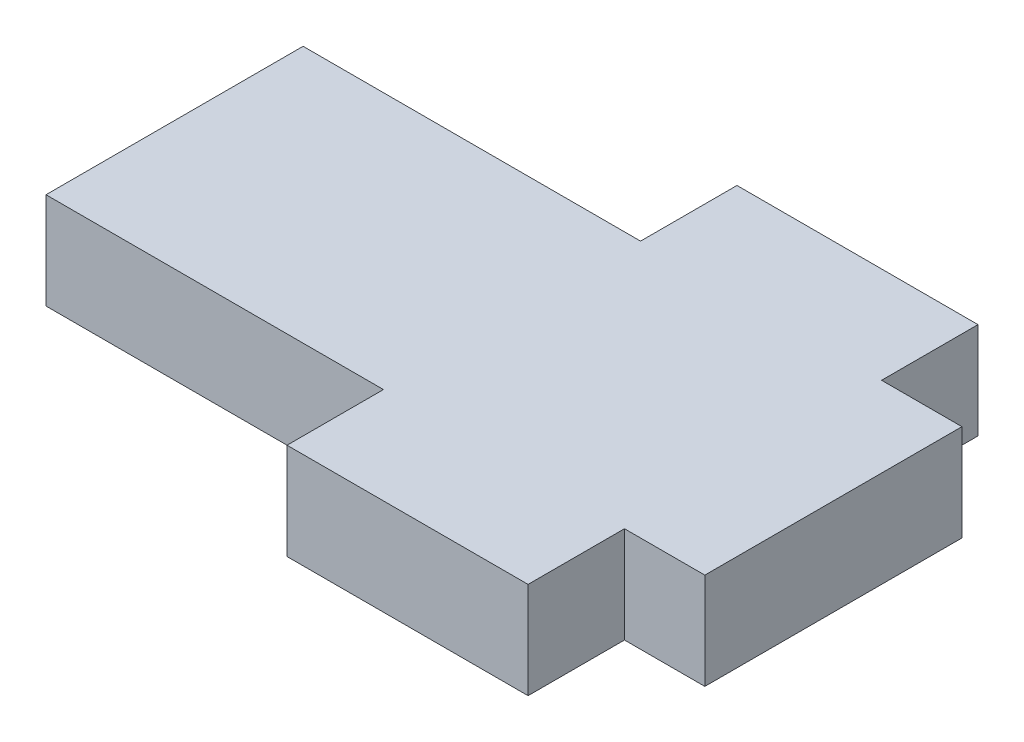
from build123d import *

# Parameters (mm, degrees)
Y_KSEKLIK_EKSTR_ZYON1_DEPTH = 6


with BuildPart() as part:
    # izim1 → Y_kseklik-Ekstr_zyon1 (new body)
    with BuildSketch(Plane(origin=(0, 0, 0), x_dir=(1, 0, 0), z_dir=(0, 1, 0))):
        Polygon((-7.5, 8), (-7.5, 14), (7.5, 14), (7.5, 8), (12.5, 8), (12.5, -8), (7.5, -8), (7.5, -14), (-7.5, -14), (-7.5, -8), (-12.5, -8), (-28.5, -8), (-28.5, 8), (-12.5, 8), align=None)
    extrude(amount=Y_KSEKLIK_EKSTR_ZYON1_DEPTH)


solid = part.part
